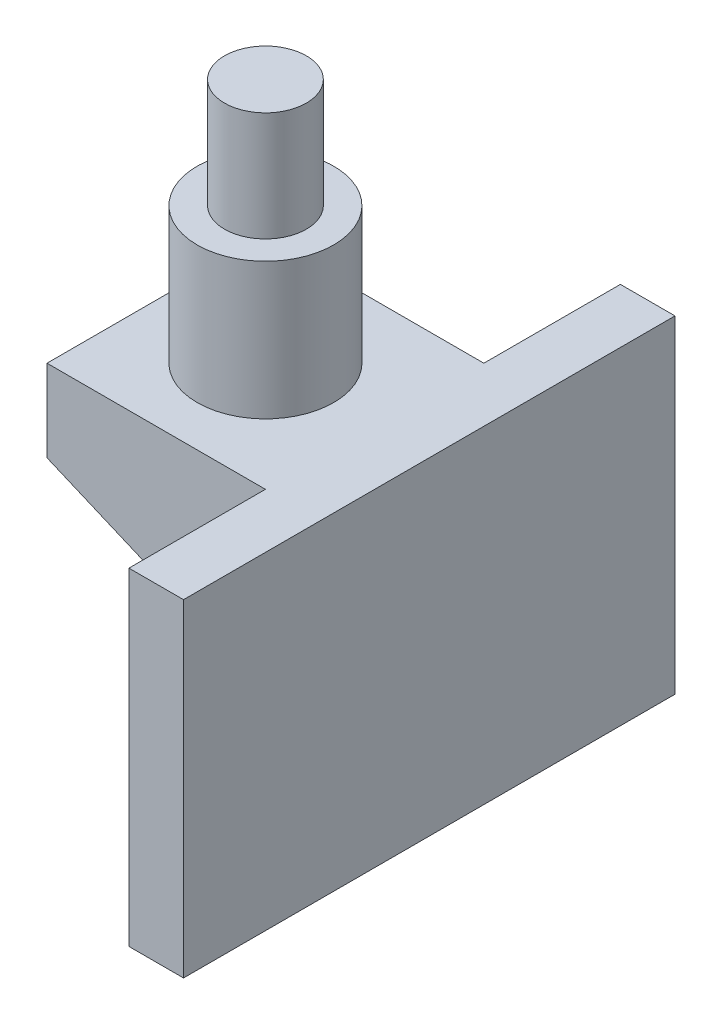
ISO-10303-21;
HEADER;
FILE_DESCRIPTION(('STEP AP214'),'2;1');
FILE_NAME('part.step','',(''),(''),'','','');
FILE_SCHEMA(('AUTOMOTIVE_DESIGN { 1 0 10303 214 1 1 1 1 }'));
ENDSEC;
DATA;
#1=APPLICATION_CONTEXT('core data for automotive mechanical design processes');
#2=APPLICATION_PROTOCOL_DEFINITION('international standard','automotive_design',2000,#1);
#3=PRODUCT_CONTEXT('',#1,'mechanical');
#4=PRODUCT('Part','Part','',(#3));
#5=PRODUCT_RELATED_PRODUCT_CATEGORY('part','',(#4));
#6=PRODUCT_DEFINITION_FORMATION('','',#4);
#7=PRODUCT_DEFINITION_CONTEXT('part definition',#1,'design');
#8=PRODUCT_DEFINITION('design','',#6,#7);
#9=PRODUCT_DEFINITION_SHAPE('','',#8);
#10=(LENGTH_UNIT() NAMED_UNIT(*) SI_UNIT(.MILLI.,.METRE.));
#11=(NAMED_UNIT(*) PLANE_ANGLE_UNIT() SI_UNIT($,.RADIAN.));
#12=(NAMED_UNIT(*) SI_UNIT($,.STERADIAN.) SOLID_ANGLE_UNIT());
#13=UNCERTAINTY_MEASURE_WITH_UNIT(LENGTH_MEASURE(1.E-05),#10,'distance_accuracy_value','');
#14=(GEOMETRIC_REPRESENTATION_CONTEXT(3) GLOBAL_UNCERTAINTY_ASSIGNED_CONTEXT((#13)) GLOBAL_UNIT_ASSIGNED_CONTEXT((#10,
#11,#12)) REPRESENTATION_CONTEXT('',''));
#15=CARTESIAN_POINT('',(0.,0.,0.));
#16=DIRECTION('',(0.,0.,1.));
#17=DIRECTION('',(1.,0.,0.));
#18=AXIS2_PLACEMENT_3D('',#15,#16,#17);
#19=CARTESIAN_POINT('',(-20.000000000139,104.999999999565,6.66133814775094E-13));
#20=DIRECTION('',(0.,-1.,0.));
#21=DIRECTION('',(0.,0.,-1.00000000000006));
#22=AXIS2_PLACEMENT_3D('',#19,#20,#21);
#23=CYLINDRICAL_SURFACE('',#22,7.5);
#24=CARTESIAN_POINT('',(-20.000000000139,104.999999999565,6.66133814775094E-13));
#25=DIRECTION('',(0.,1.,0.));
#26=DIRECTION('',(0.,0.,1.00000000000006));
#27=AXIS2_PLACEMENT_3D('',#24,#25,#26);
#28=CIRCLE('',#27,7.5);
#29=CARTESIAN_POINT('',(-20.000000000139,104.999999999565,7.50000000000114));
#30=VERTEX_POINT('',#29);
#31=EDGE_CURVE('E311',#30,#30,#28,.T.);
#32=ORIENTED_EDGE('',*,*,#31,.F.);
#33=EDGE_LOOP('',(#32));
#34=FACE_BOUND('',#33,.T.);
#35=CARTESIAN_POINT('',(-20.0000000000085,84.9999999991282,6.99440505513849E-12));
#36=DIRECTION('',(0.,1.,0.));
#37=DIRECTION('',(0.,0.,1.00000000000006));
#38=AXIS2_PLACEMENT_3D('',#35,#36,#37);
#39=CIRCLE('',#38,7.5);
#40=CARTESIAN_POINT('',(-20.0000000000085,84.9999999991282,7.50000000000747));
#41=VERTEX_POINT('',#40);
#42=EDGE_CURVE('E9',#41,#41,#39,.T.);
#43=ORIENTED_EDGE('',*,*,#42,.T.);
#44=EDGE_LOOP('',(#43));
#45=FACE_BOUND('',#44,.T.);
#46=ADVANCED_FACE('F14',(#34,#45),#23,.T.);
#47=CARTESIAN_POINT('',(-20.000000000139,104.999999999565,6.66133814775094E-13));
#48=DIRECTION('',(0.,1.,0.));
#49=DIRECTION('',(0.,0.,1.00000000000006));
#50=AXIS2_PLACEMENT_3D('',#47,#48,#49);
#51=PLANE('',#50);
#52=ORIENTED_EDGE('',*,*,#31,.T.);
#53=EDGE_LOOP('',(#52));
#54=FACE_BOUND('',#53,.T.);
#55=ADVANCED_FACE('F182',(#54),#51,.T.);
#56=CARTESIAN_POINT('',(-20.0000000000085,84.9999999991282,6.99440505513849E-12));
#57=DIRECTION('',(0.,-1.,0.));
#58=DIRECTION('',(0.,0.,-1.00000000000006));
#59=AXIS2_PLACEMENT_3D('',#56,#57,#58);
#60=CYLINDRICAL_SURFACE('',#59,12.5);
#61=CARTESIAN_POINT('',(-20.0000000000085,84.9999999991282,6.99440505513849E-12));
#62=DIRECTION('',(0.,1.,0.));
#63=DIRECTION('',(0.,0.,1.00000000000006));
#64=AXIS2_PLACEMENT_3D('',#61,#62,#63);
#65=CIRCLE('',#64,12.5);
#66=CARTESIAN_POINT('',(-20.0000000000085,84.9999999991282,12.5000000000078));
#67=VERTEX_POINT('',#66);
#68=EDGE_CURVE('E95',#67,#67,#65,.T.);
#69=ORIENTED_EDGE('',*,*,#68,.F.);
#70=EDGE_LOOP('',(#69));
#71=FACE_BOUND('',#70,.T.);
#72=CARTESIAN_POINT('',(-20.0000000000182,59.999999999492,6.99440505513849E-12));
#73=DIRECTION('',(0.,1.,0.));
#74=DIRECTION('',(0.,0.,1.00000000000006));
#75=AXIS2_PLACEMENT_3D('',#72,#73,#74);
#76=CIRCLE('',#75,12.5);
#77=CARTESIAN_POINT('',(-20.0000000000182,59.999999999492,12.5000000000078));
#78=VERTEX_POINT('',#77);
#79=EDGE_CURVE('E23',#78,#78,#76,.T.);
#80=ORIENTED_EDGE('',*,*,#79,.T.);
#81=EDGE_LOOP('',(#80));
#82=FACE_BOUND('',#81,.T.);
#83=ADVANCED_FACE('F184',(#71,#82),#60,.T.);
#84=CARTESIAN_POINT('',(-20.0000000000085,84.9999999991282,6.99440505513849E-12));
#85=DIRECTION('',(0.,1.,0.));
#86=DIRECTION('',(0.,0.,1.00000000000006));
#87=AXIS2_PLACEMENT_3D('',#84,#85,#86);
#88=PLANE('',#87);
#89=ORIENTED_EDGE('',*,*,#42,.F.);
#90=EDGE_LOOP('',(#89));
#91=FACE_BOUND('',#90,.T.);
#92=ORIENTED_EDGE('',*,*,#68,.T.);
#93=EDGE_LOOP('',(#92));
#94=FACE_BOUND('',#93,.T.);
#95=ADVANCED_FACE('F191',(#91,#94),#88,.T.);
#96=CARTESIAN_POINT('',(9.99999999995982,59.9999999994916,45.0000000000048));
#97=DIRECTION('',(0.,-1.,0.));
#98=DIRECTION('',(0.,0.,-1.00000000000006));
#99=AXIS2_PLACEMENT_3D('',#96,#97,#98);
#100=PLANE('',#99);
#101=DIRECTION('',(-1.00000000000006,0.,0.));
#102=VECTOR('',#101,1.);
#103=CARTESIAN_POINT('',(9.99999999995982,59.9999999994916,45.0000000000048));
#104=LINE('',#103,#102);
#105=CARTESIAN_POINT('',(9.99999999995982,59.9999999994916,45.0000000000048));
#106=VERTEX_POINT('',#105);
#107=CARTESIAN_POINT('',(-3.90798504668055E-11,59.9999999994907,45.0000000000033));
#108=VERTEX_POINT('',#107);
#109=EDGE_CURVE('E137',#106,#108,#104,.T.);
#110=ORIENTED_EDGE('',*,*,#109,.F.);
#111=DIRECTION('',(0.,0.,-1.00000000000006));
#112=VECTOR('',#111,1.);
#113=CARTESIAN_POINT('',(9.99999999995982,59.9999999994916,45.0000000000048));
#114=LINE('',#113,#112);
#115=CARTESIAN_POINT('',(9.99999999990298,60.0000000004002,-45.0000000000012));
#116=VERTEX_POINT('',#115);
#117=EDGE_CURVE('E149',#106,#116,#114,.T.);
#118=ORIENTED_EDGE('',*,*,#117,.T.);
#119=DIRECTION('',(-1.00000000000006,0.,0.));
#120=VECTOR('',#119,1.);
#121=CARTESIAN_POINT('',(9.99999999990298,60.0000000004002,-45.0000000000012));
#122=LINE('',#121,#120);
#123=CARTESIAN_POINT('',(2.97539770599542E-11,60.0000000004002,-45.0000000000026));
#124=VERTEX_POINT('',#123);
#125=EDGE_CURVE('E125',#116,#124,#122,.T.);
#126=ORIENTED_EDGE('',*,*,#125,.T.);
#127=DIRECTION('',(0.,0.,-1.00000000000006));
#128=VECTOR('',#127,1.);
#129=CARTESIAN_POINT('',(-3.90798504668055E-11,59.9999999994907,45.0000000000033));
#130=LINE('',#129,#128);
#131=CARTESIAN_POINT('',(3.50830475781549E-11,60.0000000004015,-19.9999999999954));
#132=VERTEX_POINT('',#131);
#133=EDGE_CURVE('E146',#132,#124,#130,.T.);
#134=ORIENTED_EDGE('',*,*,#133,.F.);
#135=DIRECTION('',(-1.00000000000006,0.,0.));
#136=VECTOR('',#135,1.);
#137=CARTESIAN_POINT('',(3.50830475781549E-11,60.0000000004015,-19.9999999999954));
#138=LINE('',#137,#136);
#139=CARTESIAN_POINT('',(-39.9999999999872,59.9999999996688,-19.9999999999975));
#140=VERTEX_POINT('',#139);
#141=EDGE_CURVE('E94',#132,#140,#138,.T.);
#142=ORIENTED_EDGE('',*,*,#141,.T.);
#143=DIRECTION('',(0.,0.,-1.00000000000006));
#144=VECTOR('',#143,1.);
#145=CARTESIAN_POINT('',(-40.0000000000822,59.9999999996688,19.9999999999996));
#146=LINE('',#145,#144);
#147=CARTESIAN_POINT('',(-40.0000000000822,59.9999999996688,19.9999999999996));
#148=VERTEX_POINT('',#147);
#149=EDGE_CURVE('E120',#148,#140,#146,.T.);
#150=ORIENTED_EDGE('',*,*,#149,.F.);
#151=DIRECTION('',(-1.00000000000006,0.,0.));
#152=VECTOR('',#151,1.);
#153=CARTESIAN_POINT('',(-6.17284001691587E-11,59.9999999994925,20.0000000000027));
#154=LINE('',#153,#152);
#155=CARTESIAN_POINT('',(-6.17284001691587E-11,59.9999999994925,20.0000000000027));
#156=VERTEX_POINT('',#155);
#157=EDGE_CURVE('E84',#156,#148,#154,.T.);
#158=ORIENTED_EDGE('',*,*,#157,.F.);
#159=EDGE_CURVE('E154',#108,#156,#130,.T.);
#160=ORIENTED_EDGE('',*,*,#159,.F.);
#161=EDGE_LOOP('',(#110,#118,#126,#134,#142,#150,#158,#160));
#162=FACE_BOUND('',#161,.T.);
#163=ORIENTED_EDGE('',*,*,#79,.F.);
#164=EDGE_LOOP('',(#163));
#165=FACE_BOUND('',#164,.T.);
#166=ADVANCED_FACE('F163',(#162,#165),#100,.F.);
#167=CARTESIAN_POINT('',(-4.9737991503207E-11,8.88178419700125E-13,45.0000000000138));
#168=DIRECTION('',(-1.00000000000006,0.,0.));
#169=DIRECTION('',(0.,0.,1.00000000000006));
#170=AXIS2_PLACEMENT_3D('',#167,#168,#169);
#171=PLANE('',#170);
#172=ORIENTED_EDGE('',*,*,#159,.T.);
#173=DIRECTION('',(0.,-1.,0.));
#174=VECTOR('',#173,1.);
#175=CARTESIAN_POINT('',(-6.17284001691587E-11,59.9999999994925,20.0000000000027));
#176=LINE('',#175,#174);
#177=CARTESIAN_POINT('',(-9.72555369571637E-11,27.9999999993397,20.0000000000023));
#178=VERTEX_POINT('',#177);
#179=EDGE_CURVE('E31',#156,#178,#176,.T.);
#180=ORIENTED_EDGE('',*,*,#179,.T.);
#181=DIRECTION('',(0.,0.,-1.00000000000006));
#182=VECTOR('',#181,1.);
#183=CARTESIAN_POINT('',(-9.72555369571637E-11,27.9999999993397,20.0000000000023));
#184=LINE('',#183,#182);
#185=CARTESIAN_POINT('',(-1.84297022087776E-10,28.0000000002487,-20.0000000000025));
#186=VERTEX_POINT('',#185);
#187=EDGE_CURVE('E77',#178,#186,#184,.T.);
#188=ORIENTED_EDGE('',*,*,#187,.T.);
#189=DIRECTION('',(0.,-1.,0.));
#190=VECTOR('',#189,1.);
#191=CARTESIAN_POINT('',(3.50830475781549E-11,60.0000000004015,-19.9999999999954));
#192=LINE('',#191,#190);
#193=EDGE_CURVE('E37',#132,#186,#192,.T.);
#194=ORIENTED_EDGE('',*,*,#193,.F.);
#195=ORIENTED_EDGE('',*,*,#133,.T.);
#196=DIRECTION('',(0.,1.,0.));
#197=VECTOR('',#196,1.);
#198=CARTESIAN_POINT('',(3.99680288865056E-12,8.88178419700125E-13,-44.9999999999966));
#199=LINE('',#198,#197);
#200=CARTESIAN_POINT('',(3.99680288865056E-12,8.88178419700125E-13,-44.9999999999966));
#201=VERTEX_POINT('',#200);
#202=EDGE_CURVE('E122',#201,#124,#199,.T.);
#203=ORIENTED_EDGE('',*,*,#202,.F.);
#204=DIRECTION('',(0.,0.,-1.00000000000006));
#205=VECTOR('',#204,1.);
#206=CARTESIAN_POINT('',(-4.9737991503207E-11,8.88178419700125E-13,45.0000000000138));
#207=LINE('',#206,#205);
#208=CARTESIAN_POINT('',(-4.9737991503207E-11,8.88178419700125E-13,45.0000000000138));
#209=VERTEX_POINT('',#208);
#210=EDGE_CURVE('E156',#209,#201,#207,.T.);
#211=ORIENTED_EDGE('',*,*,#210,.F.);
#212=DIRECTION('',(0.,1.,0.));
#213=VECTOR('',#212,1.);
#214=CARTESIAN_POINT('',(-4.9737991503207E-11,8.88178419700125E-13,45.0000000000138));
#215=LINE('',#214,#213);
#216=EDGE_CURVE('E134',#209,#108,#215,.T.);
#217=ORIENTED_EDGE('',*,*,#216,.T.);
#218=EDGE_LOOP('',(#172,#180,#188,#194,#195,#203,#211,#217));
#219=FACE_BOUND('',#218,.T.);
#220=ADVANCED_FACE('F78',(#219),#171,.T.);
#221=CARTESIAN_POINT('',(-4.9737991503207E-11,8.88178419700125E-13,45.0000000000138));
#222=DIRECTION('',(0.,1.,0.));
#223=DIRECTION('',(0.,0.,1.00000000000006));
#224=AXIS2_PLACEMENT_3D('',#221,#222,#223);
#225=PLANE('',#224);
#226=DIRECTION('',(0.,0.,-1.00000000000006));
#227=VECTOR('',#226,1.);
#228=CARTESIAN_POINT('',(9.99999999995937,1.77635683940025E-12,45.0000000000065));
#229=LINE('',#228,#227);
#230=CARTESIAN_POINT('',(9.99999999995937,1.77635683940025E-12,45.0000000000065));
#231=VERTEX_POINT('',#230);
#232=CARTESIAN_POINT('',(9.99999999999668,-8.88178419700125E-13,-44.9999999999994));
#233=VERTEX_POINT('',#232);
#234=EDGE_CURVE('E157',#231,#233,#229,.T.);
#235=ORIENTED_EDGE('',*,*,#234,.F.);
#236=DIRECTION('',(1.00000000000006,0.,0.));
#237=VECTOR('',#236,1.);
#238=CARTESIAN_POINT('',(-4.9737991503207E-11,8.88178419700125E-13,45.0000000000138));
#239=LINE('',#238,#237);
#240=EDGE_CURVE('E143',#209,#231,#239,.T.);
#241=ORIENTED_EDGE('',*,*,#240,.F.);
#242=ORIENTED_EDGE('',*,*,#210,.T.);
#243=DIRECTION('',(1.00000000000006,0.,0.));
#244=VECTOR('',#243,1.);
#245=CARTESIAN_POINT('',(3.99680288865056E-12,8.88178419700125E-13,-44.9999999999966));
#246=LINE('',#245,#244);
#247=EDGE_CURVE('E131',#201,#233,#246,.T.);
#248=ORIENTED_EDGE('',*,*,#247,.T.);
#249=EDGE_LOOP('',(#235,#241,#242,#248));
#250=FACE_BOUND('',#249,.T.);
#251=ADVANCED_FACE('F16',(#250),#225,.F.);
#252=CARTESIAN_POINT('',(9.99999999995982,59.9999999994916,45.0000000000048));
#253=DIRECTION('',(1.00000000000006,0.,0.));
#254=DIRECTION('',(0.,1.,0.));
#255=AXIS2_PLACEMENT_3D('',#252,#253,#254);
#256=PLANE('',#255);
#257=ORIENTED_EDGE('',*,*,#117,.F.);
#258=DIRECTION('',(0.,-1.,0.));
#259=VECTOR('',#258,1.);
#260=CARTESIAN_POINT('',(9.99999999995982,59.9999999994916,45.0000000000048));
#261=LINE('',#260,#259);
#262=EDGE_CURVE('E140',#106,#231,#261,.T.);
#263=ORIENTED_EDGE('',*,*,#262,.T.);
#264=ORIENTED_EDGE('',*,*,#234,.T.);
#265=DIRECTION('',(0.,-1.,0.));
#266=VECTOR('',#265,1.);
#267=CARTESIAN_POINT('',(9.99999999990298,60.0000000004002,-45.0000000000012));
#268=LINE('',#267,#266);
#269=EDGE_CURVE('E128',#116,#233,#268,.T.);
#270=ORIENTED_EDGE('',*,*,#269,.F.);
#271=EDGE_LOOP('',(#257,#263,#264,#270));
#272=FACE_BOUND('',#271,.T.);
#273=ADVANCED_FACE('F170',(#272),#256,.T.);
#274=CARTESIAN_POINT('',(-3.90798504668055E-11,59.9999999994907,45.0000000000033));
#275=DIRECTION('',(0.,0.,1.00000000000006));
#276=DIRECTION('',(1.00000000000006,0.,0.));
#277=AXIS2_PLACEMENT_3D('',#274,#275,#276);
#278=PLANE('',#277);
#279=ORIENTED_EDGE('',*,*,#216,.F.);
#280=ORIENTED_EDGE('',*,*,#240,.T.);
#281=ORIENTED_EDGE('',*,*,#262,.F.);
#282=ORIENTED_EDGE('',*,*,#109,.T.);
#283=EDGE_LOOP('',(#279,#280,#281,#282));
#284=FACE_BOUND('',#283,.T.);
#285=ADVANCED_FACE('F172',(#284),#278,.T.);
#286=CARTESIAN_POINT('',(2.97539770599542E-11,60.0000000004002,-45.0000000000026));
#287=DIRECTION('',(0.,0.,1.00000000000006));
#288=DIRECTION('',(1.00000000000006,0.,0.));
#289=AXIS2_PLACEMENT_3D('',#286,#287,#288);
#290=PLANE('',#289);
#291=ORIENTED_EDGE('',*,*,#202,.T.);
#292=ORIENTED_EDGE('',*,*,#125,.F.);
#293=ORIENTED_EDGE('',*,*,#269,.T.);
#294=ORIENTED_EDGE('',*,*,#247,.F.);
#295=EDGE_LOOP('',(#291,#292,#293,#294));
#296=FACE_BOUND('',#295,.T.);
#297=ADVANCED_FACE('F167',(#296),#290,.F.);
#298=CARTESIAN_POINT('',(-40.0000000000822,59.9999999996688,19.9999999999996));
#299=DIRECTION('',(1.00000000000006,0.,0.));
#300=DIRECTION('',(0.,0.,-1.00000000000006));
#301=AXIS2_PLACEMENT_3D('',#298,#299,#300);
#302=PLANE('',#301);
#303=DIRECTION('',(0.,0.,-1.00000000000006));
#304=VECTOR('',#303,1.);
#305=CARTESIAN_POINT('',(-40.0000000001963,45.0000000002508,20.0000000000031));
#306=LINE('',#305,#304);
#307=CARTESIAN_POINT('',(-40.0000000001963,45.0000000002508,20.0000000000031));
#308=VERTEX_POINT('',#307);
#309=CARTESIAN_POINT('',(-40.0000000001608,45.0000000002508,-19.9999999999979));
#310=VERTEX_POINT('',#309);
#311=EDGE_CURVE('E83',#308,#310,#306,.T.);
#312=ORIENTED_EDGE('',*,*,#311,.F.);
#313=DIRECTION('',(0.,-1.,0.));
#314=VECTOR('',#313,1.);
#315=CARTESIAN_POINT('',(-40.0000000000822,59.9999999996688,19.9999999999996));
#316=LINE('',#315,#314);
#317=EDGE_CURVE('E113',#148,#308,#316,.T.);
#318=ORIENTED_EDGE('',*,*,#317,.F.);
#319=ORIENTED_EDGE('',*,*,#149,.T.);
#320=DIRECTION('',(0.,-1.,0.));
#321=VECTOR('',#320,1.);
#322=CARTESIAN_POINT('',(-39.9999999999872,59.9999999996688,-19.9999999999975));
#323=LINE('',#322,#321);
#324=EDGE_CURVE('E98',#140,#310,#323,.T.);
#325=ORIENTED_EDGE('',*,*,#324,.T.);
#326=EDGE_LOOP('',(#312,#318,#319,#325));
#327=FACE_BOUND('',#326,.T.);
#328=ADVANCED_FACE('F206',(#327),#302,.F.);
#329=CARTESIAN_POINT('',(-9.72555369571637E-11,27.9999999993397,20.0000000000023));
#330=DIRECTION('',(-0.391140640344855,-0.920330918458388,0.));
#331=DIRECTION('',(0.920330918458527,-0.391140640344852,0.));
#332=AXIS2_PLACEMENT_3D('',#329,#330,#331);
#333=PLANE('',#332);
#334=DIRECTION('',(-0.920330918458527,0.391140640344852,0.));
#335=VECTOR('',#334,1.);
#336=CARTESIAN_POINT('',(-9.72555369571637E-11,27.9999999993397,20.0000000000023));
#337=LINE('',#336,#335);
#338=EDGE_CURVE('E106',#178,#308,#337,.T.);
#339=ORIENTED_EDGE('',*,*,#338,.T.);
#340=ORIENTED_EDGE('',*,*,#311,.T.);
#341=DIRECTION('',(-0.920330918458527,0.391140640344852,0.));
#342=VECTOR('',#341,1.);
#343=CARTESIAN_POINT('',(-1.84297022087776E-10,28.0000000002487,-20.0000000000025));
#344=LINE('',#343,#342);
#345=EDGE_CURVE('E91',#186,#310,#344,.T.);
#346=ORIENTED_EDGE('',*,*,#345,.F.);
#347=ORIENTED_EDGE('',*,*,#187,.F.);
#348=EDGE_LOOP('',(#339,#340,#346,#347));
#349=FACE_BOUND('',#348,.T.);
#350=ADVANCED_FACE('F97',(#349),#333,.T.);
#351=CARTESIAN_POINT('',(-6.17284001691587E-11,59.9999999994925,20.0000000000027));
#352=DIRECTION('',(0.,0.,-1.00000000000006));
#353=DIRECTION('',(-1.00000000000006,0.,0.));
#354=AXIS2_PLACEMENT_3D('',#351,#352,#353);
#355=PLANE('',#354);
#356=ORIENTED_EDGE('',*,*,#179,.F.);
#357=ORIENTED_EDGE('',*,*,#157,.T.);
#358=ORIENTED_EDGE('',*,*,#317,.T.);
#359=ORIENTED_EDGE('',*,*,#338,.F.);
#360=EDGE_LOOP('',(#356,#357,#358,#359));
#361=FACE_BOUND('',#360,.T.);
#362=ADVANCED_FACE('F203',(#361),#355,.F.);
#363=CARTESIAN_POINT('',(3.50830475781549E-11,60.0000000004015,-19.9999999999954));
#364=DIRECTION('',(0.,0.,-1.00000000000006));
#365=DIRECTION('',(-1.00000000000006,0.,0.));
#366=AXIS2_PLACEMENT_3D('',#363,#364,#365);
#367=PLANE('',#366);
#368=ORIENTED_EDGE('',*,*,#193,.T.);
#369=ORIENTED_EDGE('',*,*,#345,.T.);
#370=ORIENTED_EDGE('',*,*,#324,.F.);
#371=ORIENTED_EDGE('',*,*,#141,.F.);
#372=EDGE_LOOP('',(#368,#369,#370,#371));
#373=FACE_BOUND('',#372,.T.);
#374=ADVANCED_FACE('F89',(#373),#367,.T.);
#375=CLOSED_SHELL('',(#46,#55,#83,#95,#166,#220,#251,#273,#285,#297,#328,#350,#362,#374));
#376=MANIFOLD_SOLID_BREP('B1',#375);
#377=ADVANCED_BREP_SHAPE_REPRESENTATION('',(#18,#376),#14);
#378=SHAPE_DEFINITION_REPRESENTATION(#9,#377);
ENDSEC;
END-ISO-10303-21;
